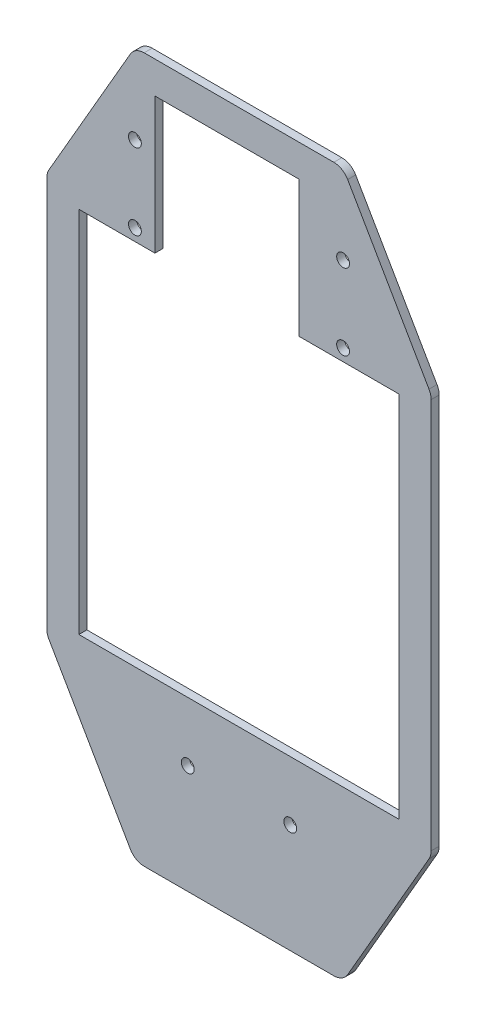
from build123d import *

# Parameters (mm, degrees)
EXTRUDE_1_DEPTH        = 30
EXTRUDE_2_DEPTH        = 40
MIRROR_2_COPY_1_DEPTH  = 40
EXTRUDE_START          = 20
SKETCH_3_W             = 200
SKETCH_3_H             = 230
EXTRUDE_3_DEPTH        = 20
EXTRUDE_START_2        = -10
EXTRUDE_11_DEPTH       = 15
FILLET_3_R             = 5
SKETCH_6_W             = 22
SKETCH_6_H             = 22
EXTRUDE_12_DEPTH       = 225
M8X1_0_1_AT_2_COUNT    = 2
M8X1_0_1_AT_2_PITCH    = 47.5
SKETCH_14_W            = 75
SKETCH_14_H            = 1
CUT_EXTRUDE_1_DEPTH    = 10
EXTRUDE_START_3        = -21
EXTRUDE_13_DEPTH       = 20
CUT_EXTRUDE_3_DEPTH    = 20
FILLET_4_R             = 5
EXTRUDE_14_REACH       = 388.297
EXTRUDE_START_4        = 5
SKETCH_20_W            = 200
SKETCH_20_H            = 230
EXTRUDE_15_DEPTH       = 5
SKETCH_24_W            = 75
SKETCH_24_H            = 85
EXTRUDE_16_DEPTH       = 30
HOLE_WIZARD_M8_1_D     = 6.8
HOLE_WIZARD_M8_1_DEPTH = 20
HOLE_WIZARD_M8_1_TIP   = 2.042926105
EXTRUDE_START_5        = -12
EXTRUDE_17_DEPTH       = 5
PATTERN_LINEAR_2_COUNT = 2
PATTERN_LINEAR_2_PITCH = 26
HOLE_WIZARD_M8_2_D     = 6.8
HOLE_WIZARD_M8_2_DEPTH = 22.5
HOLE_WIZARD_M8_2_TIP   = 2.042926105
SKETCH_32_W            = 15
SKETCH_32_H            = 85
CUT_EXTRUDE_7_DEPTH    = 30
SKETCH_33_W            = 90
SKETCH_33_H            = 85
CUT_EXTRUDE_8_DEPTH    = 12
SKETCH_34_W            = 100
SKETCH_34_H            = 59
CUT_EXTRUDE_9_DEPTH    = 9.25
SKETCH_35_W            = 350.252733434
SKETCH_35_H            = 581.551708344
CUT_EXTRUDE_10_DEPTH   = 21
CUT_EXTRUDE_START      = -5
SKETCH_53_W            = 746.993473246
SKETCH_53_H            = 735.961924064
CUT_EXTRUDE_26_DEPTH   = 110
SKETCH_54_OUTSIDE_W    = 605.222
SKETCH_54_OUTSIDE_H    = 775.222
CUT_EXTRUDE_27_DEPTH   = 110
SKETCH_57_R            = 4
CUT_EXTRUDE_28_DEPTH   = 10


with BuildPart() as part:
    # Sketch 1 → Extrude 1 (new body)
    with BuildSketch(Plane.XY):
        with BuildLine():
            Line((-118.660254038, 127.025650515), (-67.868239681, 215))
            ThreePointArc((-67.868239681, 215), (-64.207985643, 218.660254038), (-59.207985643, 220))
            Line((-59.207985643, 220), (59.207985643, 220))
            ThreePointArc((59.207985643, 220), (64.207985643, 218.660254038), (67.868239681, 215))
            Line((67.868239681, 215), (118.660254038, 127.025650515))
            ThreePointArc((118.660254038, 127.025650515), (119.659258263, 124.613840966), (120, 122.025650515))
            Line((120, 122.025650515), (120, -122.025650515))
            ThreePointArc((120, -122.025650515), (119.659258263, -124.613840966), (118.660254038, -127.025650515))
            Line((118.660254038, -127.025650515), (67.868239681, -215))
            ThreePointArc((67.868239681, -215), (64.207985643, -218.660254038), (59.207985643, -220))
            Line((59.207985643, -220), (-59.207985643, -220))
            ThreePointArc((-59.207985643, -220), (-64.207985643, -218.660254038), (-67.868239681, -215))
            Line((-67.868239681, -215), (-118.660254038, -127.025650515))
            ThreePointArc((-118.660254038, -127.025650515), (-119.659258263, -124.613840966), (-120, -122.025650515))
            Line((-120, -122.025650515), (-120, 122.025650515))
            ThreePointArc((-120, 122.025650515), (-119.659258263, 124.613840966), (-118.660254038, 127.025650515))
        make_face()
        with BuildLine():
            Line((-98.660254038, 121.666666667), (-56.321234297, 195))
            ThreePointArc((-56.321234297, 195), (-52.660980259, 198.660254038), (-47.660980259, 200))
            Line((-47.660980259, 200), (47.660980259, 200))
            ThreePointArc((47.660980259, 200), (52.660980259, 198.660254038), (56.321234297, 195))
            Line((56.321234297, 195), (98.660254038, 121.666666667))
            ThreePointArc((98.660254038, 121.666666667), (99.659258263, 119.254857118), (100, 116.666666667))
            Line((100, 116.666666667), (100, -116.666666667))
            ThreePointArc((100, -116.666666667), (99.659258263, -119.254857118), (98.660254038, -121.666666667))
            Line((98.660254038, -121.666666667), (56.321234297, -195))
            ThreePointArc((56.321234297, -195), (52.660980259, -198.660254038), (47.660980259, -200))
            Line((47.660980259, -200), (-47.660980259, -200))
            ThreePointArc((-47.660980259, -200), (-52.660980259, -198.660254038), (-56.321234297, -195))
            Line((-56.321234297, -195), (-98.660254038, -121.666666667))
            ThreePointArc((-98.660254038, -121.666666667), (-99.659258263, -119.254857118), (-100, -116.666666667))
            Line((-100, -116.666666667), (-100, 116.666666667))
            ThreePointArc((-100, 116.666666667), (-99.659258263, 119.254857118), (-98.660254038, 121.666666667))
        make_face(mode=Mode.SUBTRACT)
    extrude(amount=EXTRUDE_1_DEPTH)

    # Sketch 2 → Extrude 2 (add)
    with BuildSketch(Plane.XY.offset(30)):
        Polygon((-100, 130), (-70, 130), (-70, 200), (-37.5, 200), (-37.5, 115), (-100, 115), align=None)
    extrude_2 = extrude(amount=-EXTRUDE_2_DEPTH)

    # Mirror 1: Extrude 2 across plane
    add(extrude_2.mirror(Plane.ZX))

    # Mirror 2: Extrude 2 across plane
    add(extrude_2.mirror(Plane(origin=(0, 0, 0), x_dir=(0, 0, 1), z_dir=(1, 0, 0))))

    # Mirror 2 copy 1 sketch → Mirror 2 copy 1 (add)
    with BuildSketch(Plane(origin=(0, 0, 30), x_dir=(-1, 0, 0), z_dir=(0, 0, 1))):
        Polygon((-100, 130), (-70, 130), (-70, 200), (-37.5, 200), (-37.5, 115), (-100, 115), align=None)
    extrude(amount=-MIRROR_2_COPY_1_DEPTH)

    # Sketch 3 → Extrude 3 (add)
    with BuildSketch(Plane(origin=(0, 0, 0), x_dir=(-1, 0, 0), z_dir=(0, 0, -1)).offset(EXTRUDE_START)):
        with BuildLine():
            Line((120, -122.025650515), (120, 122.025650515))
            ThreePointArc((120, 122.025650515), (119.659258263, 124.613840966), (118.660254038, 127.025650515))
            Line((118.660254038, 127.025650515), (67.868239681, 215))
            ThreePointArc((67.868239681, 215), (64.207985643, 218.660254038), (59.207985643, 220))
            Line((59.207985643, 220), (-59.207985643, 220))
            ThreePointArc((-59.207985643, 220), (-64.207985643, 218.660254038), (-67.868239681, 215))
            Line((-67.868239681, 215), (-118.660254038, 127.025650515))
            ThreePointArc((-118.660254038, 127.025650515), (-119.659258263, 124.613840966), (-120, 122.025650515))
            Line((-120, 122.025650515), (-120, -122.025650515))
            ThreePointArc((-120, -122.025650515), (-119.659258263, -124.613840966), (-118.660254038, -127.025650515))
            Line((-118.660254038, -127.025650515), (-67.868239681, -215))
            ThreePointArc((-67.868239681, -215), (-64.207985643, -218.660254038), (-59.207985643, -220))
            Line((-59.207985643, -220), (59.207985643, -220))
            ThreePointArc((59.207985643, -220), (64.207985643, -218.660254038), (67.868239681, -215))
            Line((67.868239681, -215), (118.660254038, -127.025650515))
            ThreePointArc((118.660254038, -127.025650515), (119.659258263, -124.613840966), (120, -122.025650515))
        make_face()
        Rectangle(SKETCH_3_W, SKETCH_3_H, mode=Mode.SUBTRACT)
    extrude(amount=-EXTRUDE_3_DEPTH)

    # Sketch 5 → Extrude 11 (add)
    with BuildSketch(Plane(origin=(0, 0, -20), x_dir=(-1, 0, 0), z_dir=(0, 0, -1)).offset(EXTRUDE_START_2)):
        with BuildLine():
            Line((-67.868239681, 215), (-67.868239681, 310))
            Line((-67.868239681, 310), (67.868239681, 310))
            Line((67.868239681, 310), (67.868239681, 215))
            ThreePointArc((67.868239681, 215), (64.207985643, 218.660254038), (59.207985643, 220))
            Line((59.207985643, 220), (-59.207985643, 220))
            ThreePointArc((-59.207985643, 220), (-64.207985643, 218.660254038), (-67.868239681, 215))
        make_face()
    extrude_11 = extrude(amount=-EXTRUDE_11_DEPTH)

    # Fillet 3
    fillet_3_edges = [part.edges().sort_by_distance(p)[0] for p in [
        (67.868239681, 310, -2.5),
        (-67.868239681, 310, -2.5),
    ]]
    fillet(fillet_3_edges, radius=FILLET_3_R)

    # Sketch 6 → Extrude 12 (add, symmetric)
    with BuildSketch(Plane(origin=(0, 0, 0), x_dir=(0, 0, -1), z_dir=(1, 0, 0))):
        with Locations((6, 210)):
            Rectangle(SKETCH_6_W, SKETCH_6_H)
    extrude_12 = extrude(amount=EXTRUDE_12_DEPTH, both=True)

    # Sketch 11 → M8x1.0 _1 (revolve, cut)
    with BuildSketch(Plane(origin=(-65, 122.5, 30), x_dir=(0, -1, 0), z_dir=(1, 0, 0))):
        Polygon((0, 0), (0, 23.103012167), (3.5, 21), (3.5, 0), align=None)
    m8x1_0_1 = revolve(axis=Axis((-65, 122.5, 36.35), (0, 0, -1)), mode=Mode.SUBTRACT)

    # M8x1.0 _1 at 2: M8x1.0 _1 ×2
    with Locations(*[(0, i * M8X1_0_1_AT_2_PITCH, 0) for i in range(1, M8X1_0_1_AT_2_COUNT)]):
        add(m8x1_0_1, mode=Mode.SUBTRACT)

    # Mirror 7: M8x1.0 _1 across plane
    add(m8x1_0_1.mirror(Plane(origin=(0, 0, 0), x_dir=(0, 0, 1), z_dir=(1, 0, 0))), mode=Mode.SUBTRACT)

    # Mirror 7 copy 1 sketch → Mirror 7 copy 1 (revolve, cut)
    with BuildSketch(Plane(origin=(65, 170, 30), x_dir=(0, -1, 0), z_dir=(-1, 0, 0))):
        Polygon((0, 0), (0, -23.103012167), (3.5, -21), (3.5, 0), align=None)
    revolve(axis=Axis((65, 170, 36.35), (0, 0, 1)), mode=Mode.SUBTRACT)

    # Sketch 14 → Cut-Extrude 1 (cut)
    with BuildSketch(Plane.XY):
        with Locations((0, 199.5)):
            Rectangle(SKETCH_14_W, SKETCH_14_H)
    cut_extrude_1 = extrude(amount=CUT_EXTRUDE_1_DEPTH, mode=Mode.SUBTRACT)

    # Mirror 8: Extrude 11, Extrude 12, Cut-Extrude 1 across plane
    add(extrude_11.mirror(Plane.ZX))
    add(extrude_12.mirror(Plane.ZX))
    add(cut_extrude_1.mirror(Plane.ZX), mode=Mode.SUBTRACT)

    # Sketch 16 → Extrude 13 (add)
    with BuildSketch(Plane.XY.offset(5).offset(EXTRUDE_START_3)):
        with BuildLine():
            Line((135, 199), (135, -199))
            Line((135, -199), (77.105843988, -199))
            Line((77.105843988, -199), (118.660254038, -127.025650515))
            ThreePointArc((118.660254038, -127.025650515), (119.659258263, -124.613840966), (120, -122.025650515))
            Line((120, -122.025650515), (120, 122.025650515))
            ThreePointArc((120, 122.025650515), (119.659258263, 124.613840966), (118.660254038, 127.025650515))
            Line((118.660254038, 127.025650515), (77.105843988, 199))
            Line((77.105843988, 199), (135, 199))
        make_face()
        with BuildLine():
            Line((-135, 199), (-77.105843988, 199))
            Line((-77.105843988, 199), (-118.660254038, 127.025650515))
            ThreePointArc((-118.660254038, 127.025650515), (-119.659258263, 124.613840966), (-120, 122.025650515))
            Line((-120, 122.025650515), (-120, -122.025650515))
            ThreePointArc((-120, -122.025650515), (-119.659258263, -124.613840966), (-118.660254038, -127.025650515))
            Line((-118.660254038, -127.025650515), (-77.105843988, -199))
            Line((-77.105843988, -199), (-135, -199))
            Line((-135, -199), (-135, 199))
        make_face()
    extrude(amount=EXTRUDE_13_DEPTH)

    # Sketch 17 → Cut-Extrude 3 (cut)
    with BuildSketch(Plane.XY.offset(4)):
        Polygon((105.973357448, 199), (135, 148.724380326), (135, 199), align=None)
        Polygon((135, -199), (105.973357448, -199), (135, -148.724380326), align=None)
        Polygon((-105.973357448, -199), (-135, -148.724380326), (-135, -199), align=None)
        Polygon((-135, 199), (-105.973357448, 199), (-135, 148.724380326), align=None)
    extrude(amount=-CUT_EXTRUDE_3_DEPTH, mode=Mode.SUBTRACT)

    # Fillet 4
    fillet_4_edges = [part.edges().sort_by_distance(p)[0] for p in [
        (-135, 148.724380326, -6),
        (-105.973357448, 199, -6),
        (-105.973357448, -199, -6),
        (-135, -148.724380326, -6),
        (135, -148.724380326, -6),
        (105.973357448, -199, -6),
        (105.973357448, 199, -6),
        (135, 148.724380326, -6),
    ]]
    fillet(fillet_4_edges, radius=FILLET_4_R)

    # Sketch 19 → Extrude 14 (add, up to next)
    with BuildSketch(Plane.XY.offset(30), mode=Mode.PRIVATE) as extrude_14_sk1:
        Polygon((-93.849001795, 130), (-70, 130), (-70, 171.307682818), align=None)
    extrude_14_tool1 = extrude(extrude_14_sk1.sketch, amount=-EXTRUDE_14_REACH, mode=Mode.PRIVATE) - part.part
    # Sketch 19 → Extrude 14 (add, up to next)
    with BuildSketch(Plane.XY.offset(30), mode=Mode.PRIVATE) as extrude_14_sk2:
        Polygon((93.849001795, 130), (70, 171.307682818), (70, 130), align=None)
    extrude_14_tool2 = extrude(extrude_14_sk2.sketch, amount=-EXTRUDE_14_REACH, mode=Mode.PRIVATE) - part.part
    # Sketch 19 → Extrude 14 (add, up to next)
    with BuildSketch(Plane.XY.offset(30), mode=Mode.PRIVATE) as extrude_14_sk3:
        Polygon((93.849001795, -130), (70, -130), (70, -171.307682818), align=None)
    extrude_14_tool3 = extrude(extrude_14_sk3.sketch, amount=-EXTRUDE_14_REACH, mode=Mode.PRIVATE) - part.part
    # Sketch 19 → Extrude 14 (add, up to next)
    with BuildSketch(Plane.XY.offset(30), mode=Mode.PRIVATE) as extrude_14_sk4:
        Polygon((-93.849001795, -130), (-70, -171.307682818), (-70, -130), align=None)
    extrude_14_tool4 = extrude(extrude_14_sk4.sketch, amount=-EXTRUDE_14_REACH, mode=Mode.PRIVATE) - part.part
    add(extrude_14_tool1.solids().sort_by_distance((-77.949667, 143.769228, 30))[0])
    add(extrude_14_tool2.solids().sort_by_distance((77.949667, 143.769228, 30))[0])
    add(extrude_14_tool3.solids().sort_by_distance((77.949667, -143.769228, 30))[0])
    add(extrude_14_tool4.solids().sort_by_distance((-77.949667, -143.769228, 30))[0])

    # Sketch 20 → Extrude 15 (add)
    with BuildSketch(Plane(origin=(0, 0, -20), x_dir=(-1, 0, 0), z_dir=(0, 0, -1)).offset(EXTRUDE_START_4)):
        with BuildLine():
            Line((120, -122.025650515), (120, 122.025650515))
            ThreePointArc((120, 122.025650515), (119.659258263, 124.613840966), (118.660254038, 127.025650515))
            Line((118.660254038, 127.025650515), (67.868239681, 215))
            ThreePointArc((67.868239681, 215), (64.207985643, 218.660254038), (59.207985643, 220))
            Line((59.207985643, 220), (-59.207985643, 220))
            ThreePointArc((-59.207985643, 220), (-64.207985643, 218.660254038), (-67.868239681, 215))
            Line((-67.868239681, 215), (-118.660254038, 127.025650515))
            ThreePointArc((-118.660254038, 127.025650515), (-119.659258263, 124.613840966), (-120, 122.025650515))
            Line((-120, 122.025650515), (-120, -122.025650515))
            ThreePointArc((-120, -122.025650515), (-119.659258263, -124.613840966), (-118.660254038, -127.025650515))
            Line((-118.660254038, -127.025650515), (-67.868239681, -215))
            ThreePointArc((-67.868239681, -215), (-64.207985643, -218.660254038), (-59.207985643, -220))
            Line((-59.207985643, -220), (59.207985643, -220))
            ThreePointArc((59.207985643, -220), (64.207985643, -218.660254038), (67.868239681, -215))
            Line((67.868239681, -215), (118.660254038, -127.025650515))
            ThreePointArc((118.660254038, -127.025650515), (119.659258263, -124.613840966), (120, -122.025650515))
        make_face()
        Rectangle(SKETCH_20_W, SKETCH_20_H, mode=Mode.SUBTRACT)
    extrude(amount=-EXTRUDE_15_DEPTH)

    # Sketch 24 → Extrude 16 (add)
    with BuildSketch(Plane.XY):
        with Locations((0, -157.5)):
            Rectangle(SKETCH_24_W, SKETCH_24_H)
    extrude(amount=EXTRUDE_16_DEPTH)

    # Hole Wizard M8 _1
    with Locations(Plane(origin=(0, -115, -22), x_dir=(0, 0, 1), z_dir=(0, 1, 0))):
        with Locations((0, 0)):
            Hole(HOLE_WIZARD_M8_1_D / 2, depth=HOLE_WIZARD_M8_1_DEPTH)
            with Locations((0, 0, -(HOLE_WIZARD_M8_1_DEPTH + HOLE_WIZARD_M8_1_TIP / 2))):  # 118° drill point
                Cone(0, HOLE_WIZARD_M8_1_D / 2, HOLE_WIZARD_M8_1_TIP, mode=Mode.SUBTRACT)

    # Sketch 27 → Extrude 17 (add)
    with BuildSketch(Plane.XY.offset(30).offset(EXTRUDE_START_5)):
        Polygon((-16, -115), (-16, -105), (16, -105), (16, -115), (12, -115), (12, -111), (-12, -111), (-12, -115), align=None)
    extrude_17 = extrude(amount=-EXTRUDE_17_DEPTH)

    # Pattern Linear 2: Extrude 17 ×2
    with Locations(*[(0, 0, -i * PATTERN_LINEAR_2_PITCH) for i in range(1, PATTERN_LINEAR_2_COUNT)]):
        add(extrude_17)

    # Hole Wizard M8 _2
    with Locations(Plane(origin=(-32, -152, 30), x_dir=(1, 0, 0), z_dir=(0, 0, 1))):
        with Locations((0, 0), (64, 0)):
            Hole(HOLE_WIZARD_M8_2_D / 2, depth=HOLE_WIZARD_M8_2_DEPTH)
            with Locations((0, 0, -(HOLE_WIZARD_M8_2_DEPTH + HOLE_WIZARD_M8_2_TIP / 2))):  # 118° drill point
                Cone(0, HOLE_WIZARD_M8_2_D / 2, HOLE_WIZARD_M8_2_TIP, mode=Mode.SUBTRACT)

    # Sketch 32 → Cut-Extrude 7 (cut)
    with BuildSketch(Plane.XY.offset(30)):
        with Locations((-45, 157.5)):
            Rectangle(SKETCH_32_W, SKETCH_32_H)
    extrude(amount=-CUT_EXTRUDE_7_DEPTH, mode=Mode.SUBTRACT)

    # Sketch 33 → Cut-Extrude 8 (cut)
    with BuildSketch(Plane.XY):
        with Locations((-7.5, 157.5)):
            Rectangle(SKETCH_33_W, SKETCH_33_H)
    extrude(amount=-CUT_EXTRUDE_8_DEPTH, mode=Mode.SUBTRACT)

    # Sketch 34 → Cut-Extrude 9 (cut)
    with BuildSketch(Plane.XY.offset(30)):
        with Locations((0, -144.5)):
            Rectangle(SKETCH_34_W, SKETCH_34_H)
    extrude(amount=-CUT_EXTRUDE_9_DEPTH, mode=Mode.SUBTRACT)

    # Sketch 35 → Cut-Extrude 10 (cut)
    with BuildSketch(Plane.XY.offset(30)):
        Rectangle(SKETCH_35_W, SKETCH_35_H)
    extrude(amount=-CUT_EXTRUDE_10_DEPTH, mode=Mode.SUBTRACT)

    # Sketch 53 → Cut-Extrude 26 (cut)
    with BuildSketch(Plane.XY.offset(9).offset(CUT_EXTRUDE_START)):
        Rectangle(SKETCH_53_W, SKETCH_53_H)
    extrude(amount=-CUT_EXTRUDE_26_DEPTH, mode=Mode.SUBTRACT)

    # Sketch 54 outside → Cut-Extrude 27 (cut)
    with BuildSketch(Plane.XY.offset(9)):
        Rectangle(SKETCH_54_OUTSIDE_W, SKETCH_54_OUTSIDE_H)
        with BuildLine():
            Line((59.207985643, 220), (-59.207985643, 220))
            ThreePointArc((-59.207985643, 220), (-64.207985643, 218.660254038), (-67.868239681, 215))
            Line((-67.868239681, 215), (-118.660254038, 127.025650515))
            ThreePointArc((-118.660254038, 127.025650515), (-119.659258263, 124.613840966), (-120, 122.025650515))
            Line((-120, 122.025650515), (-120, -122.025650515))
            ThreePointArc((-120, -122.025650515), (-119.659258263, -124.613840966), (-118.660254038, -127.025650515))
            Line((-118.660254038, -127.025650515), (-67.868239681, -215))
            ThreePointArc((-67.868239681, -215), (-64.207985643, -218.660254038), (-59.207985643, -220))
            Line((-59.207985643, -220), (59.207985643, -220))
            ThreePointArc((59.207985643, -220), (64.207985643, -218.660254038), (67.868239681, -215))
            Line((67.868239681, -215), (118.660254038, -127.025650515))
            ThreePointArc((118.660254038, -127.025650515), (119.659258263, -124.613840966), (120, -122.025650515))
            Line((120, -122.025650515), (120, 122.025650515))
            ThreePointArc((120, 122.025650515), (119.659258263, 124.613840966), (118.660254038, 127.025650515))
            Line((118.660254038, 127.025650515), (67.868239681, 215))
            ThreePointArc((67.868239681, 215), (64.207985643, 218.660254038), (59.207985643, 220))
        make_face(mode=Mode.SUBTRACT)
    extrude(amount=-CUT_EXTRUDE_27_DEPTH, mode=Mode.SUBTRACT)

    # Sketch 57 → Cut-Extrude 28 (cut)
    with BuildSketch(Plane.XY.offset(9)):
        with Locations((65, 122.5)):
            Circle(SKETCH_57_R)
        with Locations((65, 170)):
            Circle(SKETCH_57_R)
        with Locations((32, -152)):
            Circle(SKETCH_57_R)
    cut_extrude_28 = extrude(amount=-CUT_EXTRUDE_28_DEPTH, mode=Mode.SUBTRACT)

    # Mirror 9: Cut-Extrude 28 across plane
    add(cut_extrude_28.mirror(Plane(origin=(0, 0, 0), x_dir=(0, 0, 1), z_dir=(1, 0, 0))), mode=Mode.SUBTRACT)


solid = part.part
